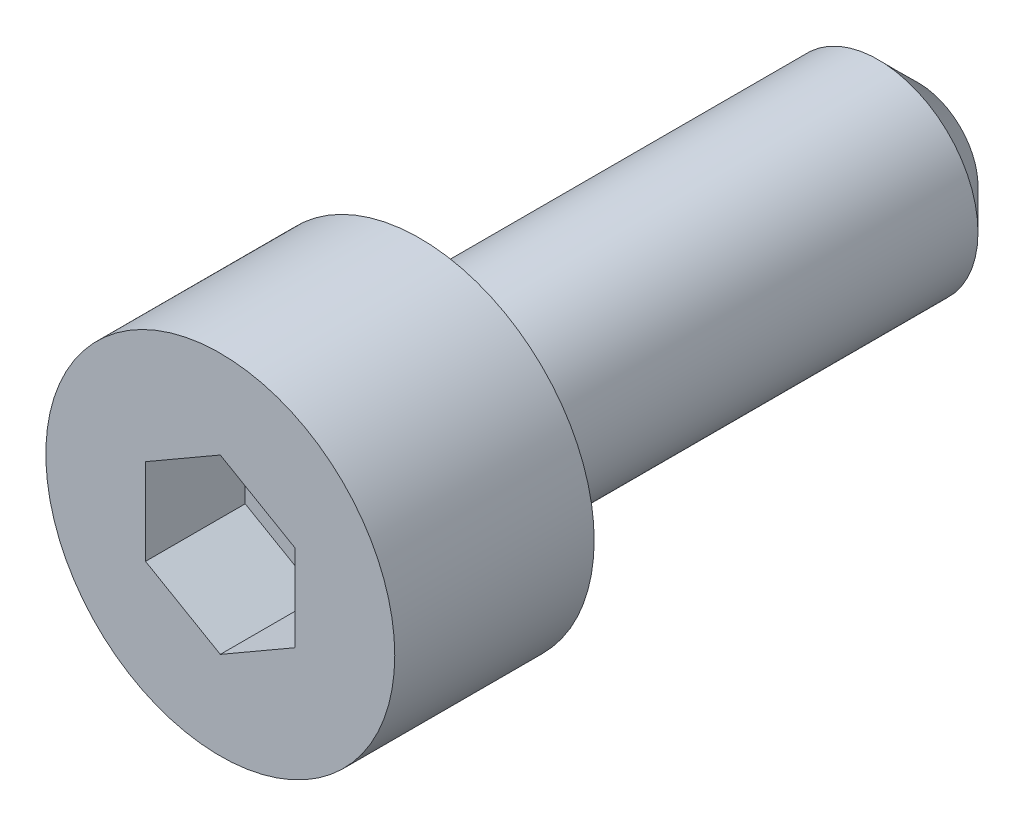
ISO-10303-21;
HEADER;
FILE_DESCRIPTION(('STEP AP214'),'2;1');
FILE_NAME('part.step','',(''),(''),'','','');
FILE_SCHEMA(('AUTOMOTIVE_DESIGN { 1 0 10303 214 1 1 1 1 }'));
ENDSEC;
DATA;
#1=APPLICATION_CONTEXT('core data for automotive mechanical design processes');
#2=APPLICATION_PROTOCOL_DEFINITION('international standard','automotive_design',2000,#1);
#3=PRODUCT_CONTEXT('',#1,'mechanical');
#4=PRODUCT('Part','Part','',(#3));
#5=PRODUCT_RELATED_PRODUCT_CATEGORY('part','',(#4));
#6=PRODUCT_DEFINITION_FORMATION('','',#4);
#7=PRODUCT_DEFINITION_CONTEXT('part definition',#1,'design');
#8=PRODUCT_DEFINITION('design','',#6,#7);
#9=PRODUCT_DEFINITION_SHAPE('','',#8);
#10=(LENGTH_UNIT() NAMED_UNIT(*) SI_UNIT(.MILLI.,.METRE.));
#11=(NAMED_UNIT(*) PLANE_ANGLE_UNIT() SI_UNIT($,.RADIAN.));
#12=(NAMED_UNIT(*) SI_UNIT($,.STERADIAN.) SOLID_ANGLE_UNIT());
#13=UNCERTAINTY_MEASURE_WITH_UNIT(LENGTH_MEASURE(1.E-05),#10,'distance_accuracy_value','');
#14=(GEOMETRIC_REPRESENTATION_CONTEXT(3) GLOBAL_UNCERTAINTY_ASSIGNED_CONTEXT((#13)) GLOBAL_UNIT_ASSIGNED_CONTEXT((#10,
#11,#12)) REPRESENTATION_CONTEXT('',''));
#15=CARTESIAN_POINT('',(0.,0.,0.));
#16=DIRECTION('',(0.,0.,1.));
#17=DIRECTION('',(1.,0.,0.));
#18=AXIS2_PLACEMENT_3D('',#15,#16,#17);
#19=CARTESIAN_POINT('',(0.,1.73205080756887,2.));
#20=DIRECTION('',(-0.5,-0.86602540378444,0.));
#21=DIRECTION('',(0.86602540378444,-0.5,0.));
#22=AXIS2_PLACEMENT_3D('',#19,#20,#21);
#23=PLANE('',#22);
#24=DIRECTION('',(0.,0.,1.));
#25=VECTOR('',#24,1.);
#26=CARTESIAN_POINT('',(1.5,0.866025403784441,2.));
#27=LINE('',#26,#25);
#28=CARTESIAN_POINT('',(1.5,0.866025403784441,2.));
#29=VERTEX_POINT('',#28);
#30=CARTESIAN_POINT('',(1.5,0.866025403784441,4.));
#31=VERTEX_POINT('',#30);
#32=EDGE_CURVE('E63',#29,#31,#27,.T.);
#33=ORIENTED_EDGE('',*,*,#32,.T.);
#34=DIRECTION('',(0.86602540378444,-0.5,0.));
#35=VECTOR('',#34,1.);
#36=CARTESIAN_POINT('',(0.,1.73205080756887,4.));
#37=LINE('',#36,#35);
#38=CARTESIAN_POINT('',(0.,1.73205080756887,4.));
#39=VERTEX_POINT('',#38);
#40=EDGE_CURVE('E29',#39,#31,#37,.T.);
#41=ORIENTED_EDGE('',*,*,#40,.F.);
#42=DIRECTION('',(0.,0.,1.));
#43=VECTOR('',#42,1.);
#44=CARTESIAN_POINT('',(0.,1.73205080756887,2.));
#45=LINE('',#44,#43);
#46=CARTESIAN_POINT('',(0.,1.73205080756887,2.));
#47=VERTEX_POINT('',#46);
#48=EDGE_CURVE('E33',#47,#39,#45,.T.);
#49=ORIENTED_EDGE('',*,*,#48,.F.);
#50=DIRECTION('',(0.86602540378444,-0.5,0.));
#51=VECTOR('',#50,1.);
#52=CARTESIAN_POINT('',(0.,1.73205080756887,2.));
#53=LINE('',#52,#51);
#54=EDGE_CURVE('E65',#47,#29,#53,.T.);
#55=ORIENTED_EDGE('',*,*,#54,.T.);
#56=EDGE_LOOP('',(#33,#41,#49,#55));
#57=FACE_BOUND('',#56,.T.);
#58=ADVANCED_FACE('F14',(#57),#23,.T.);
#59=CARTESIAN_POINT('',(1.5,-0.866025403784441,2.));
#60=DIRECTION('',(1.,0.,0.));
#61=DIRECTION('',(0.,1.,0.));
#62=AXIS2_PLACEMENT_3D('',#59,#60,#61);
#63=PLANE('',#62);
#64=DIRECTION('',(0.,0.,1.));
#65=VECTOR('',#64,1.);
#66=CARTESIAN_POINT('',(1.5,-0.866025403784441,2.));
#67=LINE('',#66,#65);
#68=CARTESIAN_POINT('',(1.5,-0.866025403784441,2.));
#69=VERTEX_POINT('',#68);
#70=CARTESIAN_POINT('',(1.5,-0.866025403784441,4.));
#71=VERTEX_POINT('',#70);
#72=EDGE_CURVE('E70',#69,#71,#67,.T.);
#73=ORIENTED_EDGE('',*,*,#72,.T.);
#74=DIRECTION('',(0.,1.,0.));
#75=VECTOR('',#74,1.);
#76=CARTESIAN_POINT('',(1.5,-0.866025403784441,4.));
#77=LINE('',#76,#75);
#78=EDGE_CURVE('E73',#71,#31,#77,.T.);
#79=ORIENTED_EDGE('',*,*,#78,.T.);
#80=ORIENTED_EDGE('',*,*,#32,.F.);
#81=DIRECTION('',(0.,1.,0.));
#82=VECTOR('',#81,1.);
#83=CARTESIAN_POINT('',(1.5,-0.866025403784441,2.));
#84=LINE('',#83,#82);
#85=EDGE_CURVE('E100',#69,#29,#84,.T.);
#86=ORIENTED_EDGE('',*,*,#85,.F.);
#87=EDGE_LOOP('',(#73,#79,#80,#86));
#88=FACE_BOUND('',#87,.T.);
#89=ADVANCED_FACE('F74',(#88),#63,.F.);
#90=CARTESIAN_POINT('',(0.,-1.73205080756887,2.));
#91=DIRECTION('',(0.5,-0.86602540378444,0.));
#92=DIRECTION('',(0.86602540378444,0.5,0.));
#93=AXIS2_PLACEMENT_3D('',#90,#91,#92);
#94=PLANE('',#93);
#95=DIRECTION('',(0.,0.,1.));
#96=VECTOR('',#95,1.);
#97=CARTESIAN_POINT('',(0.,-1.73205080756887,2.));
#98=LINE('',#97,#96);
#99=CARTESIAN_POINT('',(0.,-1.73205080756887,2.));
#100=VERTEX_POINT('',#99);
#101=CARTESIAN_POINT('',(0.,-1.73205080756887,4.));
#102=VERTEX_POINT('',#101);
#103=EDGE_CURVE('E108',#100,#102,#98,.T.);
#104=ORIENTED_EDGE('',*,*,#103,.T.);
#105=DIRECTION('',(0.86602540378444,0.5,0.));
#106=VECTOR('',#105,1.);
#107=CARTESIAN_POINT('',(0.,-1.73205080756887,4.));
#108=LINE('',#107,#106);
#109=EDGE_CURVE('E78',#102,#71,#108,.T.);
#110=ORIENTED_EDGE('',*,*,#109,.T.);
#111=ORIENTED_EDGE('',*,*,#72,.F.);
#112=DIRECTION('',(0.86602540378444,0.5,0.));
#113=VECTOR('',#112,1.);
#114=CARTESIAN_POINT('',(0.,-1.73205080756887,2.));
#115=LINE('',#114,#113);
#116=EDGE_CURVE('E97',#100,#69,#115,.T.);
#117=ORIENTED_EDGE('',*,*,#116,.F.);
#118=EDGE_LOOP('',(#104,#110,#111,#117));
#119=FACE_BOUND('',#118,.T.);
#120=ADVANCED_FACE('F139',(#119),#94,.F.);
#121=CARTESIAN_POINT('',(0.,-1.73205080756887,2.));
#122=DIRECTION('',(0.5,0.86602540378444,0.));
#123=DIRECTION('',(-0.86602540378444,0.5,0.));
#124=AXIS2_PLACEMENT_3D('',#121,#122,#123);
#125=PLANE('',#124);
#126=DIRECTION('',(0.,0.,1.));
#127=VECTOR('',#126,1.);
#128=CARTESIAN_POINT('',(-1.5,-0.866025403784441,2.));
#129=LINE('',#128,#127);
#130=CARTESIAN_POINT('',(-1.5,-0.866025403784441,2.));
#131=VERTEX_POINT('',#130);
#132=CARTESIAN_POINT('',(-1.5,-0.866025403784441,4.));
#133=VERTEX_POINT('',#132);
#134=EDGE_CURVE('E106',#131,#133,#129,.T.);
#135=ORIENTED_EDGE('',*,*,#134,.T.);
#136=DIRECTION('',(-0.86602540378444,0.5,0.));
#137=VECTOR('',#136,1.);
#138=CARTESIAN_POINT('',(0.,-1.73205080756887,4.));
#139=LINE('',#138,#137);
#140=EDGE_CURVE('E185',#102,#133,#139,.T.);
#141=ORIENTED_EDGE('',*,*,#140,.F.);
#142=ORIENTED_EDGE('',*,*,#103,.F.);
#143=DIRECTION('',(-0.86602540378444,0.5,0.));
#144=VECTOR('',#143,1.);
#145=CARTESIAN_POINT('',(0.,-1.73205080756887,2.));
#146=LINE('',#145,#144);
#147=EDGE_CURVE('E94',#100,#131,#146,.T.);
#148=ORIENTED_EDGE('',*,*,#147,.T.);
#149=EDGE_LOOP('',(#135,#141,#142,#148));
#150=FACE_BOUND('',#149,.T.);
#151=ADVANCED_FACE('F151',(#150),#125,.T.);
#152=CARTESIAN_POINT('',(-1.5,0.866025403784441,2.));
#153=DIRECTION('',(-1.,0.,0.));
#154=DIRECTION('',(0.,-1.,0.));
#155=AXIS2_PLACEMENT_3D('',#152,#153,#154);
#156=PLANE('',#155);
#157=DIRECTION('',(0.,0.,1.));
#158=VECTOR('',#157,1.);
#159=CARTESIAN_POINT('',(-1.5,0.866025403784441,2.));
#160=LINE('',#159,#158);
#161=CARTESIAN_POINT('',(-1.5,0.866025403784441,2.));
#162=VERTEX_POINT('',#161);
#163=CARTESIAN_POINT('',(-1.5,0.866025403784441,4.));
#164=VERTEX_POINT('',#163);
#165=EDGE_CURVE('E104',#162,#164,#160,.T.);
#166=ORIENTED_EDGE('',*,*,#165,.T.);
#167=DIRECTION('',(0.,-1.,0.));
#168=VECTOR('',#167,1.);
#169=CARTESIAN_POINT('',(-1.5,0.866025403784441,4.));
#170=LINE('',#169,#168);
#171=EDGE_CURVE('E186',#164,#133,#170,.T.);
#172=ORIENTED_EDGE('',*,*,#171,.T.);
#173=ORIENTED_EDGE('',*,*,#134,.F.);
#174=DIRECTION('',(0.,-1.,0.));
#175=VECTOR('',#174,1.);
#176=CARTESIAN_POINT('',(-1.5,0.866025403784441,2.));
#177=LINE('',#176,#175);
#178=EDGE_CURVE('E91',#162,#131,#177,.T.);
#179=ORIENTED_EDGE('',*,*,#178,.F.);
#180=EDGE_LOOP('',(#166,#172,#173,#179));
#181=FACE_BOUND('',#180,.T.);
#182=ADVANCED_FACE('F147',(#181),#156,.F.);
#183=CARTESIAN_POINT('',(0.,1.73205080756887,2.));
#184=DIRECTION('',(-0.5,0.86602540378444,0.));
#185=DIRECTION('',(-0.86602540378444,-0.5,0.));
#186=AXIS2_PLACEMENT_3D('',#183,#184,#185);
#187=PLANE('',#186);
#188=DIRECTION('',(-0.86602540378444,-0.5,0.));
#189=VECTOR('',#188,1.);
#190=CARTESIAN_POINT('',(0.,1.73205080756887,2.));
#191=LINE('',#190,#189);
#192=EDGE_CURVE('E88',#47,#162,#191,.T.);
#193=ORIENTED_EDGE('',*,*,#192,.F.);
#194=ORIENTED_EDGE('',*,*,#48,.T.);
#195=DIRECTION('',(-0.86602540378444,-0.5,0.));
#196=VECTOR('',#195,1.);
#197=CARTESIAN_POINT('',(0.,1.73205080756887,4.));
#198=LINE('',#197,#196);
#199=EDGE_CURVE('E84',#39,#164,#198,.T.);
#200=ORIENTED_EDGE('',*,*,#199,.T.);
#201=ORIENTED_EDGE('',*,*,#165,.F.);
#202=EDGE_LOOP('',(#193,#194,#200,#201));
#203=FACE_BOUND('',#202,.T.);
#204=ADVANCED_FACE('F144',(#203),#187,.F.);
#205=CARTESIAN_POINT('',(1.5,0.866025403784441,2.));
#206=DIRECTION('',(0.,0.,1.));
#207=DIRECTION('',(1.,0.,0.));
#208=AXIS2_PLACEMENT_3D('',#205,#206,#207);
#209=PLANE('',#208);
#210=ORIENTED_EDGE('',*,*,#54,.F.);
#211=ORIENTED_EDGE('',*,*,#192,.T.);
#212=ORIENTED_EDGE('',*,*,#178,.T.);
#213=ORIENTED_EDGE('',*,*,#147,.F.);
#214=ORIENTED_EDGE('',*,*,#116,.T.);
#215=ORIENTED_EDGE('',*,*,#85,.T.);
#216=EDGE_LOOP('',(#210,#211,#212,#213,#214,#215));
#217=FACE_BOUND('',#216,.T.);
#218=ADVANCED_FACE('F143',(#217),#209,.T.);
#219=CARTESIAN_POINT('',(0.,0.,4.));
#220=DIRECTION('',(0.,0.,1.));
#221=DIRECTION('',(1.,0.,0.));
#222=AXIS2_PLACEMENT_3D('',#219,#220,#221);
#223=PLANE('',#222);
#224=CARTESIAN_POINT('',(0.,0.,4.));
#225=DIRECTION('',(0.,0.,1.));
#226=DIRECTION('',(1.,0.,0.));
#227=AXIS2_PLACEMENT_3D('',#224,#225,#226);
#228=CIRCLE('',#227,3.5);
#229=CARTESIAN_POINT('',(3.5,0.,4.));
#230=VERTEX_POINT('',#229);
#231=EDGE_CURVE('E116',#230,#230,#228,.T.);
#232=ORIENTED_EDGE('',*,*,#231,.T.);
#233=EDGE_LOOP('',(#232));
#234=FACE_BOUND('',#233,.T.);
#235=ORIENTED_EDGE('',*,*,#199,.F.);
#236=ORIENTED_EDGE('',*,*,#40,.T.);
#237=ORIENTED_EDGE('',*,*,#78,.F.);
#238=ORIENTED_EDGE('',*,*,#109,.F.);
#239=ORIENTED_EDGE('',*,*,#140,.T.);
#240=ORIENTED_EDGE('',*,*,#171,.F.);
#241=EDGE_LOOP('',(#235,#236,#237,#238,#239,#240));
#242=FACE_BOUND('',#241,.T.);
#243=ADVANCED_FACE('F81',(#234,#242),#223,.T.);
#244=CARTESIAN_POINT('',(0.,0.,10.));
#245=DIRECTION('',(0.,0.,1.));
#246=DIRECTION('',(1.,0.,0.));
#247=AXIS2_PLACEMENT_3D('',#244,#245,#246);
#248=CYLINDRICAL_SURFACE('',#247,3.5);
#249=CARTESIAN_POINT('',(0.,0.,0.));
#250=DIRECTION('',(0.,0.,1.));
#251=DIRECTION('',(1.,0.,0.));
#252=AXIS2_PLACEMENT_3D('',#249,#250,#251);
#253=CIRCLE('',#252,3.5);
#254=CARTESIAN_POINT('',(3.5,0.,0.));
#255=VERTEX_POINT('',#254);
#256=EDGE_CURVE('E113',#255,#255,#253,.T.);
#257=ORIENTED_EDGE('',*,*,#256,.T.);
#258=EDGE_LOOP('',(#257));
#259=FACE_BOUND('',#258,.T.);
#260=ORIENTED_EDGE('',*,*,#231,.F.);
#261=EDGE_LOOP('',(#260));
#262=FACE_BOUND('',#261,.T.);
#263=ADVANCED_FACE('F164',(#259,#262),#248,.T.);
#264=CARTESIAN_POINT('',(3.5,0.,0.));
#265=DIRECTION('',(0.,0.,-1.));
#266=DIRECTION('',(-1.,0.,0.));
#267=AXIS2_PLACEMENT_3D('',#264,#265,#266);
#268=PLANE('',#267);
#269=CARTESIAN_POINT('',(0.,0.,0.));
#270=DIRECTION('',(0.,0.,1.));
#271=DIRECTION('',(1.,0.,0.));
#272=AXIS2_PLACEMENT_3D('',#269,#270,#271);
#273=CIRCLE('',#272,2.);
#274=CARTESIAN_POINT('',(2.,0.,0.));
#275=VERTEX_POINT('',#274);
#276=EDGE_CURVE('E69',#275,#275,#273,.T.);
#277=ORIENTED_EDGE('',*,*,#276,.T.);
#278=EDGE_LOOP('',(#277));
#279=FACE_BOUND('',#278,.T.);
#280=ORIENTED_EDGE('',*,*,#256,.F.);
#281=EDGE_LOOP('',(#280));
#282=FACE_BOUND('',#281,.T.);
#283=ADVANCED_FACE('F161',(#279,#282),#268,.T.);
#284=CARTESIAN_POINT('',(0.,0.,10.));
#285=DIRECTION('',(0.,0.,1.));
#286=DIRECTION('',(1.,0.,0.));
#287=AXIS2_PLACEMENT_3D('',#284,#285,#286);
#288=CYLINDRICAL_SURFACE('',#287,2.);
#289=CARTESIAN_POINT('',(0.,0.,-9.2));
#290=DIRECTION('',(0.,0.,-1.));
#291=DIRECTION('',(-1.,0.,0.));
#292=AXIS2_PLACEMENT_3D('',#289,#290,#291);
#293=CIRCLE('',#292,2.);
#294=CARTESIAN_POINT('',(-2.,0.,-9.2));
#295=VERTEX_POINT('',#294);
#296=EDGE_CURVE('E22',#295,#295,#293,.F.);
#297=ORIENTED_EDGE('',*,*,#296,.T.);
#298=EDGE_LOOP('',(#297));
#299=FACE_BOUND('',#298,.T.);
#300=ORIENTED_EDGE('',*,*,#276,.F.);
#301=EDGE_LOOP('',(#300));
#302=FACE_BOUND('',#301,.T.);
#303=ADVANCED_FACE('F121',(#299,#302),#288,.T.);
#304=CARTESIAN_POINT('',(2.,0.,-10.));
#305=DIRECTION('',(0.,0.,-1.));
#306=DIRECTION('',(-1.,0.,0.));
#307=AXIS2_PLACEMENT_3D('',#304,#305,#306);
#308=PLANE('',#307);
#309=CARTESIAN_POINT('',(0.,0.,-10.));
#310=DIRECTION('',(0.,0.,-1.));
#311=DIRECTION('',(-1.,0.,0.));
#312=AXIS2_PLACEMENT_3D('',#309,#310,#311);
#313=CIRCLE('',#312,1.2);
#314=CARTESIAN_POINT('',(-1.2,0.,-10.));
#315=VERTEX_POINT('',#314);
#316=EDGE_CURVE('E9',#315,#315,#313,.T.);
#317=ORIENTED_EDGE('',*,*,#316,.T.);
#318=EDGE_LOOP('',(#317));
#319=FACE_BOUND('',#318,.T.);
#320=ADVANCED_FACE('F125',(#319),#308,.T.);
#321=CARTESIAN_POINT('',(0.,0.,-9.2));
#322=DIRECTION('',(0.,0.,1.));
#323=DIRECTION('',(1.,0.,0.));
#324=AXIS2_PLACEMENT_3D('',#321,#322,#323);
#325=CONICAL_SURFACE('',#324,2.,0.785398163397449);
#326=ORIENTED_EDGE('',*,*,#316,.F.);
#327=EDGE_LOOP('',(#326));
#328=FACE_BOUND('',#327,.T.);
#329=ORIENTED_EDGE('',*,*,#296,.F.);
#330=EDGE_LOOP('',(#329));
#331=FACE_BOUND('',#330,.T.);
#332=ADVANCED_FACE('F16',(#328,#331),#325,.T.);
#333=CLOSED_SHELL('',(#58,#89,#120,#151,#182,#204,#218,#243,#263,#283,#303,#320,#332));
#334=MANIFOLD_SOLID_BREP('B1',#333);
#335=ADVANCED_BREP_SHAPE_REPRESENTATION('',(#18,#334),#14);
#336=SHAPE_DEFINITION_REPRESENTATION(#9,#335);
ENDSEC;
END-ISO-10303-21;
